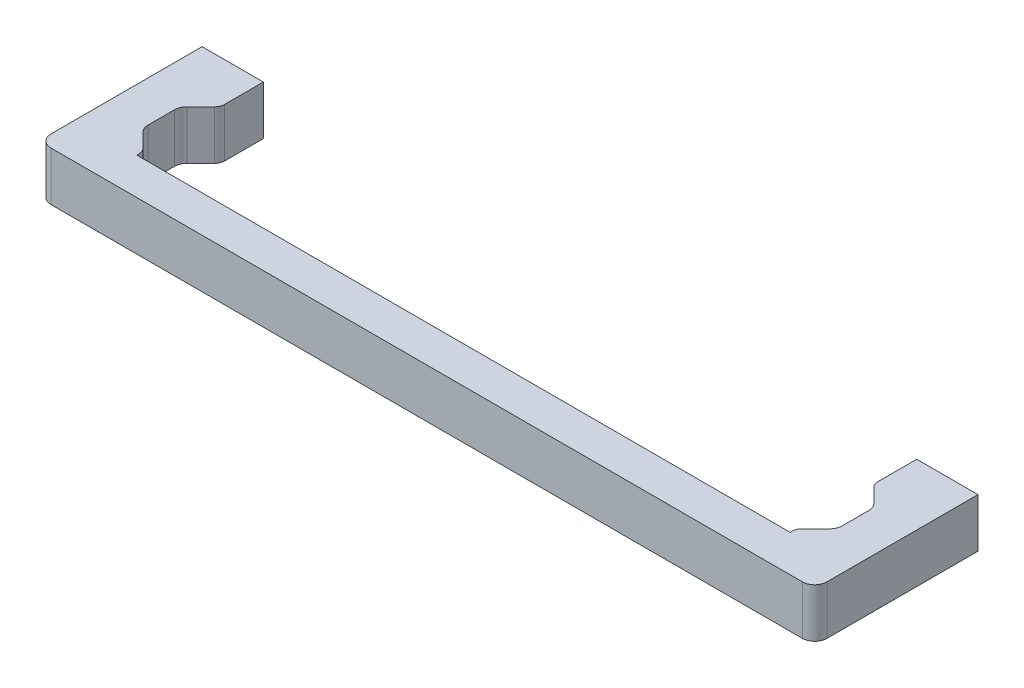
ISO-10303-21;
HEADER;
FILE_DESCRIPTION(('STEP AP214'),'2;1');
FILE_NAME('part.step','',(''),(''),'','','');
FILE_SCHEMA(('AUTOMOTIVE_DESIGN { 1 0 10303 214 1 1 1 1 }'));
ENDSEC;
DATA;
#1=APPLICATION_CONTEXT('core data for automotive mechanical design processes');
#2=APPLICATION_PROTOCOL_DEFINITION('international standard','automotive_design',2000,#1);
#3=PRODUCT_CONTEXT('',#1,'mechanical');
#4=PRODUCT('Part','Part','',(#3));
#5=PRODUCT_RELATED_PRODUCT_CATEGORY('part','',(#4));
#6=PRODUCT_DEFINITION_FORMATION('','',#4);
#7=PRODUCT_DEFINITION_CONTEXT('part definition',#1,'design');
#8=PRODUCT_DEFINITION('design','',#6,#7);
#9=PRODUCT_DEFINITION_SHAPE('','',#8);
#10=(LENGTH_UNIT() NAMED_UNIT(*) SI_UNIT(.MILLI.,.METRE.));
#11=(NAMED_UNIT(*) PLANE_ANGLE_UNIT() SI_UNIT($,.RADIAN.));
#12=(NAMED_UNIT(*) SI_UNIT($,.STERADIAN.) SOLID_ANGLE_UNIT());
#13=UNCERTAINTY_MEASURE_WITH_UNIT(LENGTH_MEASURE(1.E-05),#10,'distance_accuracy_value','');
#14=(GEOMETRIC_REPRESENTATION_CONTEXT(3) GLOBAL_UNCERTAINTY_ASSIGNED_CONTEXT((#13)) GLOBAL_UNIT_ASSIGNED_CONTEXT((#10,
#11,#12)) REPRESENTATION_CONTEXT('',''));
#15=CARTESIAN_POINT('',(0.,0.,0.));
#16=DIRECTION('',(0.,0.,1.));
#17=DIRECTION('',(1.,0.,0.));
#18=AXIS2_PLACEMENT_3D('',#15,#16,#17);
#19=CARTESIAN_POINT('',(-1.999375,-6.,36.998073));
#20=DIRECTION('',(0.,1.,0.));
#21=DIRECTION('',(-1.,0.,0.));
#22=AXIS2_PLACEMENT_3D('',#19,#20,#21);
#23=CYLINDRICAL_SURFACE('',#22,2.999844);
#24=DIRECTION('',(0.,1.,0.));
#25=VECTOR('',#24,1.);
#26=CARTESIAN_POINT('',(-4.999219,-6.,36.998073));
#27=LINE('',#26,#25);
#28=CARTESIAN_POINT('',(-4.999219,-6.,36.998073));
#29=VERTEX_POINT('',#28);
#30=CARTESIAN_POINT('',(-4.999219,6.,36.998073));
#31=VERTEX_POINT('',#30);
#32=EDGE_CURVE('E9',#29,#31,#27,.T.);
#33=ORIENTED_EDGE('',*,*,#32,.F.);
#34=CARTESIAN_POINT('',(-1.999375,-6.,36.998073));
#35=DIRECTION('',(0.,-1.,0.));
#36=DIRECTION('',(1.,0.,0.));
#37=AXIS2_PLACEMENT_3D('',#34,#35,#36);
#38=CIRCLE('',#37,2.999844);
#39=CARTESIAN_POINT('',(-1.999375,-6.,39.997917));
#40=VERTEX_POINT('',#39);
#41=EDGE_CURVE('E277',#40,#29,#38,.T.);
#42=ORIENTED_EDGE('',*,*,#41,.F.);
#43=DIRECTION('',(0.,1.,0.));
#44=VECTOR('',#43,1.);
#45=CARTESIAN_POINT('',(-1.999375,-6.,39.997917));
#46=LINE('',#45,#44);
#47=CARTESIAN_POINT('',(-1.999375,6.,39.997917));
#48=VERTEX_POINT('',#47);
#49=EDGE_CURVE('E29',#40,#48,#46,.T.);
#50=ORIENTED_EDGE('',*,*,#49,.T.);
#51=CARTESIAN_POINT('',(-1.999375,6.,36.998073));
#52=DIRECTION('',(0.,-1.,0.));
#53=DIRECTION('',(1.,0.,0.));
#54=AXIS2_PLACEMENT_3D('',#51,#52,#53);
#55=CIRCLE('',#54,2.999844);
#56=EDGE_CURVE('E197',#48,#31,#55,.T.);
#57=ORIENTED_EDGE('',*,*,#56,.T.);
#58=EDGE_LOOP('',(#33,#42,#50,#57));
#59=FACE_BOUND('',#58,.T.);
#60=ADVANCED_FACE('F14',(#59),#23,.T.);
#61=CARTESIAN_POINT('',(-4.999219,-6.,36.998073));
#62=DIRECTION('',(1.,0.,0.));
#63=DIRECTION('',(0.,1.,0.));
#64=AXIS2_PLACEMENT_3D('',#61,#62,#63);
#65=PLANE('',#64);
#66=DIRECTION('',(0.,1.,0.));
#67=VECTOR('',#66,1.);
#68=CARTESIAN_POINT('',(-4.999219,-6.,0.));
#69=LINE('',#68,#67);
#70=CARTESIAN_POINT('',(-4.999219,-6.,0.));
#71=VERTEX_POINT('',#70);
#72=CARTESIAN_POINT('',(-4.999219,6.,0.));
#73=VERTEX_POINT('',#72);
#74=EDGE_CURVE('E22',#71,#73,#69,.T.);
#75=ORIENTED_EDGE('',*,*,#74,.F.);
#76=DIRECTION('',(0.,0.,-1.));
#77=VECTOR('',#76,1.);
#78=CARTESIAN_POINT('',(-4.999219,-6.,36.998073));
#79=LINE('',#78,#77);
#80=EDGE_CURVE('E193',#29,#71,#79,.T.);
#81=ORIENTED_EDGE('',*,*,#80,.F.);
#82=ORIENTED_EDGE('',*,*,#32,.T.);
#83=DIRECTION('',(0.,0.,-1.));
#84=VECTOR('',#83,1.);
#85=CARTESIAN_POINT('',(-4.999219,6.,36.998073));
#86=LINE('',#85,#84);
#87=EDGE_CURVE('E190',#31,#73,#86,.T.);
#88=ORIENTED_EDGE('',*,*,#87,.T.);
#89=EDGE_LOOP('',(#75,#81,#82,#88));
#90=FACE_BOUND('',#89,.T.);
#91=ADVANCED_FACE('F16',(#90),#65,.F.);
#92=CARTESIAN_POINT('',(-4.999219,-6.,0.));
#93=DIRECTION('',(0.,0.,1.));
#94=DIRECTION('',(0.,-1.,0.));
#95=AXIS2_PLACEMENT_3D('',#92,#93,#94);
#96=PLANE('',#95);
#97=CARTESIAN_POINT('',(0.,0.,0.));
#98=DIRECTION('',(0.,0.,-1.));
#99=DIRECTION('',(0.,1.,0.));
#100=AXIS2_PLACEMENT_3D('',#97,#98,#99);
#101=CIRCLE('',#100,2.5);
#102=CARTESIAN_POINT('',(0.,2.5,0.));
#103=VERTEX_POINT('',#102);
#104=EDGE_CURVE('E763',#103,#103,#101,.T.);
#105=ORIENTED_EDGE('',*,*,#104,.F.);
#106=EDGE_LOOP('',(#105));
#107=FACE_BOUND('',#106,.T.);
#108=DIRECTION('',(0.,1.,0.));
#109=VECTOR('',#108,1.);
#110=CARTESIAN_POINT('',(10.,-6.,0.));
#111=LINE('',#110,#109);
#112=CARTESIAN_POINT('',(10.,-6.,0.));
#113=VERTEX_POINT('',#112);
#114=CARTESIAN_POINT('',(10.,6.,0.));
#115=VERTEX_POINT('',#114);
#116=EDGE_CURVE('E394',#113,#115,#111,.T.);
#117=ORIENTED_EDGE('',*,*,#116,.F.);
#118=DIRECTION('',(1.,0.,0.));
#119=VECTOR('',#118,1.);
#120=CARTESIAN_POINT('',(-4.999219,-6.,0.));
#121=LINE('',#120,#119);
#122=EDGE_CURVE('E280',#71,#113,#121,.T.);
#123=ORIENTED_EDGE('',*,*,#122,.F.);
#124=ORIENTED_EDGE('',*,*,#74,.T.);
#125=DIRECTION('',(1.,0.,0.));
#126=VECTOR('',#125,1.);
#127=CARTESIAN_POINT('',(-4.999219,6.,0.));
#128=LINE('',#127,#126);
#129=EDGE_CURVE('E205',#73,#115,#128,.T.);
#130=ORIENTED_EDGE('',*,*,#129,.T.);
#131=EDGE_LOOP('',(#117,#123,#124,#130));
#132=FACE_BOUND('',#131,.T.);
#133=ADVANCED_FACE('F397',(#107,#132),#96,.F.);
#134=CARTESIAN_POINT('',(10.,-6.,0.));
#135=DIRECTION('',(-1.,0.,0.));
#136=DIRECTION('',(0.,0.,-1.));
#137=AXIS2_PLACEMENT_3D('',#134,#135,#136);
#138=PLANE('',#137);
#139=DIRECTION('',(0.,1.,0.));
#140=VECTOR('',#139,1.);
#141=CARTESIAN_POINT('',(10.,-6.,9.463973));
#142=LINE('',#141,#140);
#143=CARTESIAN_POINT('',(10.,-6.,9.463973));
#144=VERTEX_POINT('',#143);
#145=CARTESIAN_POINT('',(10.,6.,9.463973));
#146=VERTEX_POINT('',#145);
#147=EDGE_CURVE('E392',#144,#146,#142,.T.);
#148=ORIENTED_EDGE('',*,*,#147,.F.);
#149=DIRECTION('',(0.,0.,1.));
#150=VECTOR('',#149,1.);
#151=CARTESIAN_POINT('',(10.,-6.,0.));
#152=LINE('',#151,#150);
#153=EDGE_CURVE('E283',#113,#144,#152,.T.);
#154=ORIENTED_EDGE('',*,*,#153,.F.);
#155=ORIENTED_EDGE('',*,*,#116,.T.);
#156=DIRECTION('',(0.,0.,1.));
#157=VECTOR('',#156,1.);
#158=CARTESIAN_POINT('',(10.,6.,0.));
#159=LINE('',#158,#157);
#160=EDGE_CURVE('E207',#115,#146,#159,.T.);
#161=ORIENTED_EDGE('',*,*,#160,.T.);
#162=EDGE_LOOP('',(#148,#154,#155,#161));
#163=FACE_BOUND('',#162,.T.);
#164=ADVANCED_FACE('F486',(#163),#138,.F.);
#165=CARTESIAN_POINT('',(7.50013,-6.,9.463973));
#166=DIRECTION('',(0.,1.,0.));
#167=DIRECTION('',(-1.,0.,0.));
#168=AXIS2_PLACEMENT_3D('',#165,#166,#167);
#169=CYLINDRICAL_SURFACE('',#168,2.49987);
#170=DIRECTION('',(0.,1.,0.));
#171=VECTOR('',#170,1.);
#172=CARTESIAN_POINT('',(9.26780502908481,-6.,11.2316480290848));
#173=LINE('',#172,#171);
#174=CARTESIAN_POINT('',(9.26780502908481,-6.,11.2316480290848));
#175=VERTEX_POINT('',#174);
#176=CARTESIAN_POINT('',(9.26780502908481,6.,11.2316480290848));
#177=VERTEX_POINT('',#176);
#178=EDGE_CURVE('E390',#175,#177,#173,.T.);
#179=ORIENTED_EDGE('',*,*,#178,.F.);
#180=CARTESIAN_POINT('',(7.50013,-6.,9.463973));
#181=DIRECTION('',(0.,-1.,0.));
#182=DIRECTION('',(1.,0.,0.));
#183=AXIS2_PLACEMENT_3D('',#180,#181,#182);
#184=CIRCLE('',#183,2.49987);
#185=EDGE_CURVE('E286',#144,#175,#184,.T.);
#186=ORIENTED_EDGE('',*,*,#185,.F.);
#187=ORIENTED_EDGE('',*,*,#147,.T.);
#188=CARTESIAN_POINT('',(7.50013,6.,9.463973));
#189=DIRECTION('',(0.,-1.,0.));
#190=DIRECTION('',(1.,0.,0.));
#191=AXIS2_PLACEMENT_3D('',#188,#189,#190);
#192=CIRCLE('',#191,2.49987);
#193=EDGE_CURVE('E213',#146,#177,#192,.T.);
#194=ORIENTED_EDGE('',*,*,#193,.T.);
#195=EDGE_LOOP('',(#179,#186,#187,#194));
#196=FACE_BOUND('',#195,.T.);
#197=ADVANCED_FACE('F484',(#196),#169,.T.);
#198=CARTESIAN_POINT('',(5.87889396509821,-6.,14.6205589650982));
#199=DIRECTION('',(0.707106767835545,0.,0.70710679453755));
#200=DIRECTION('',(-0.70710679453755,0.,0.707106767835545));
#201=AXIS2_PLACEMENT_3D('',#198,#199,#200);
#202=PLANE('',#201);
#203=DIRECTION('',(0.,1.,0.));
#204=VECTOR('',#203,1.);
#205=CARTESIAN_POINT('',(5.87889396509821,-6.,14.6205589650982));
#206=LINE('',#205,#204);
#207=CARTESIAN_POINT('',(5.87889396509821,-6.,14.6205589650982));
#208=VERTEX_POINT('',#207);
#209=CARTESIAN_POINT('',(5.87889396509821,6.,14.6205589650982));
#210=VERTEX_POINT('',#209);
#211=EDGE_CURVE('E388',#208,#210,#206,.T.);
#212=ORIENTED_EDGE('',*,*,#211,.F.);
#213=DIRECTION('',(0.70710679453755,0.,-0.707106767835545));
#214=VECTOR('',#213,1.);
#215=CARTESIAN_POINT('',(5.87889396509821,-6.,14.6205589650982));
#216=LINE('',#215,#214);
#217=EDGE_CURVE('E289',#208,#175,#216,.T.);
#218=ORIENTED_EDGE('',*,*,#217,.T.);
#219=ORIENTED_EDGE('',*,*,#178,.T.);
#220=DIRECTION('',(0.70710679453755,0.,-0.707106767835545));
#221=VECTOR('',#220,1.);
#222=CARTESIAN_POINT('',(5.87889396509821,6.,14.6205589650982));
#223=LINE('',#222,#221);
#224=EDGE_CURVE('E216',#210,#177,#223,.T.);
#225=ORIENTED_EDGE('',*,*,#224,.F.);
#226=EDGE_LOOP('',(#212,#218,#219,#225));
#227=FACE_BOUND('',#226,.T.);
#228=ADVANCED_FACE('F480',(#227),#202,.T.);
#229=CARTESIAN_POINT('',(8.000104,-6.,16.741769));
#230=DIRECTION('',(0.,1.,0.));
#231=DIRECTION('',(-1.,0.,0.));
#232=AXIS2_PLACEMENT_3D('',#229,#230,#231);
#233=CYLINDRICAL_SURFACE('',#232,2.999844);
#234=DIRECTION('',(0.,1.,0.));
#235=VECTOR('',#234,1.);
#236=CARTESIAN_POINT('',(5.00026,-6.,16.741769));
#237=LINE('',#236,#235);
#238=CARTESIAN_POINT('',(5.00026,-6.,16.741769));
#239=VERTEX_POINT('',#238);
#240=CARTESIAN_POINT('',(5.00026,6.,16.741769));
#241=VERTEX_POINT('',#240);
#242=EDGE_CURVE('E386',#239,#241,#237,.T.);
#243=ORIENTED_EDGE('',*,*,#242,.F.);
#244=CARTESIAN_POINT('',(8.000104,-6.,16.741769));
#245=DIRECTION('',(0.,-1.,0.));
#246=DIRECTION('',(1.,0.,0.));
#247=AXIS2_PLACEMENT_3D('',#244,#245,#246);
#248=CIRCLE('',#247,2.999844);
#249=EDGE_CURVE('E292',#239,#208,#248,.T.);
#250=ORIENTED_EDGE('',*,*,#249,.T.);
#251=ORIENTED_EDGE('',*,*,#211,.T.);
#252=CARTESIAN_POINT('',(8.000104,6.,16.741769));
#253=DIRECTION('',(0.,-1.,0.));
#254=DIRECTION('',(1.,0.,0.));
#255=AXIS2_PLACEMENT_3D('',#252,#253,#254);
#256=CIRCLE('',#255,2.999844);
#257=EDGE_CURVE('E219',#241,#210,#256,.T.);
#258=ORIENTED_EDGE('',*,*,#257,.F.);
#259=EDGE_LOOP('',(#243,#250,#251,#258));
#260=FACE_BOUND('',#259,.T.);
#261=ADVANCED_FACE('F476',(#260),#233,.F.);
#262=CARTESIAN_POINT('',(5.00026,-6.,23.256148));
#263=DIRECTION('',(1.,0.,0.));
#264=DIRECTION('',(0.,1.,0.));
#265=AXIS2_PLACEMENT_3D('',#262,#263,#264);
#266=PLANE('',#265);
#267=DIRECTION('',(0.,1.,0.));
#268=VECTOR('',#267,1.);
#269=CARTESIAN_POINT('',(5.00026,-6.,23.256148));
#270=LINE('',#269,#268);
#271=CARTESIAN_POINT('',(5.00026,-6.,23.256148));
#272=VERTEX_POINT('',#271);
#273=CARTESIAN_POINT('',(5.00026,6.,23.256148));
#274=VERTEX_POINT('',#273);
#275=EDGE_CURVE('E384',#272,#274,#270,.T.);
#276=ORIENTED_EDGE('',*,*,#275,.F.);
#277=DIRECTION('',(0.,0.,-1.));
#278=VECTOR('',#277,1.);
#279=CARTESIAN_POINT('',(5.00026,-6.,23.256148));
#280=LINE('',#279,#278);
#281=EDGE_CURVE('E295',#272,#239,#280,.T.);
#282=ORIENTED_EDGE('',*,*,#281,.T.);
#283=ORIENTED_EDGE('',*,*,#242,.T.);
#284=DIRECTION('',(0.,0.,-1.));
#285=VECTOR('',#284,1.);
#286=CARTESIAN_POINT('',(5.00026,6.,23.256148));
#287=LINE('',#286,#285);
#288=EDGE_CURVE('E222',#274,#241,#287,.T.);
#289=ORIENTED_EDGE('',*,*,#288,.F.);
#290=EDGE_LOOP('',(#276,#282,#283,#289));
#291=FACE_BOUND('',#290,.T.);
#292=ADVANCED_FACE('F472',(#291),#266,.T.);
#293=CARTESIAN_POINT('',(8.000104,-6.,23.256148));
#294=DIRECTION('',(0.,1.,0.));
#295=DIRECTION('',(-1.,0.,0.));
#296=AXIS2_PLACEMENT_3D('',#293,#294,#295);
#297=CYLINDRICAL_SURFACE('',#296,2.999844);
#298=DIRECTION('',(0.,1.,0.));
#299=VECTOR('',#298,1.);
#300=CARTESIAN_POINT('',(5.87889396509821,-6.,25.3773580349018));
#301=LINE('',#300,#299);
#302=CARTESIAN_POINT('',(5.87889396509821,-6.,25.3773580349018));
#303=VERTEX_POINT('',#302);
#304=CARTESIAN_POINT('',(5.87889396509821,6.,25.3773580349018));
#305=VERTEX_POINT('',#304);
#306=EDGE_CURVE('E382',#303,#305,#301,.T.);
#307=ORIENTED_EDGE('',*,*,#306,.F.);
#308=CARTESIAN_POINT('',(8.000104,-6.,23.256148));
#309=DIRECTION('',(0.,-1.,0.));
#310=DIRECTION('',(1.,0.,0.));
#311=AXIS2_PLACEMENT_3D('',#308,#309,#310);
#312=CIRCLE('',#311,2.999844);
#313=EDGE_CURVE('E298',#303,#272,#312,.T.);
#314=ORIENTED_EDGE('',*,*,#313,.T.);
#315=ORIENTED_EDGE('',*,*,#275,.T.);
#316=CARTESIAN_POINT('',(8.000104,6.,23.256148));
#317=DIRECTION('',(0.,-1.,0.));
#318=DIRECTION('',(1.,0.,0.));
#319=AXIS2_PLACEMENT_3D('',#316,#317,#318);
#320=CIRCLE('',#319,2.999844);
#321=EDGE_CURVE('E225',#305,#274,#320,.T.);
#322=ORIENTED_EDGE('',*,*,#321,.F.);
#323=EDGE_LOOP('',(#307,#314,#315,#322));
#324=FACE_BOUND('',#323,.T.);
#325=ADVANCED_FACE('F468',(#324),#297,.F.);
#326=CARTESIAN_POINT('',(5.87889396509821,-6.,25.3773580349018));
#327=DIRECTION('',(-0.707106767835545,0.,0.70710679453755));
#328=DIRECTION('',(-0.70710679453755,0.,-0.707106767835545));
#329=AXIS2_PLACEMENT_3D('',#326,#327,#328);
#330=PLANE('',#329);
#331=DIRECTION('',(0.,1.,0.));
#332=VECTOR('',#331,1.);
#333=CARTESIAN_POINT('',(9.26780502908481,-6.,28.7662689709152));
#334=LINE('',#333,#332);
#335=CARTESIAN_POINT('',(9.26780502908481,-6.,28.7662689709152));
#336=VERTEX_POINT('',#335);
#337=CARTESIAN_POINT('',(9.26780502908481,6.,28.7662689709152));
#338=VERTEX_POINT('',#337);
#339=EDGE_CURVE('E380',#336,#338,#334,.T.);
#340=ORIENTED_EDGE('',*,*,#339,.F.);
#341=DIRECTION('',(0.70710679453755,0.,0.707106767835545));
#342=VECTOR('',#341,1.);
#343=CARTESIAN_POINT('',(5.87889396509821,-6.,25.3773580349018));
#344=LINE('',#343,#342);
#345=EDGE_CURVE('E301',#303,#336,#344,.T.);
#346=ORIENTED_EDGE('',*,*,#345,.F.);
#347=ORIENTED_EDGE('',*,*,#306,.T.);
#348=DIRECTION('',(0.70710679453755,0.,0.707106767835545));
#349=VECTOR('',#348,1.);
#350=CARTESIAN_POINT('',(5.87889396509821,6.,25.3773580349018));
#351=LINE('',#350,#349);
#352=EDGE_CURVE('E228',#305,#338,#351,.T.);
#353=ORIENTED_EDGE('',*,*,#352,.T.);
#354=EDGE_LOOP('',(#340,#346,#347,#353));
#355=FACE_BOUND('',#354,.T.);
#356=ADVANCED_FACE('F464',(#355),#330,.F.);
#357=CARTESIAN_POINT('',(7.50013,-6.,30.533944));
#358=DIRECTION('',(0.,1.,0.));
#359=DIRECTION('',(-1.,0.,0.));
#360=AXIS2_PLACEMENT_3D('',#357,#358,#359);
#361=CYLINDRICAL_SURFACE('',#360,2.49987);
#362=DIRECTION('',(0.,1.,0.));
#363=VECTOR('',#362,1.);
#364=CARTESIAN_POINT('',(10.,-6.,30.533944));
#365=LINE('',#364,#363);
#366=CARTESIAN_POINT('',(10.,-6.,30.533944));
#367=VERTEX_POINT('',#366);
#368=CARTESIAN_POINT('',(10.,6.,30.533944));
#369=VERTEX_POINT('',#368);
#370=EDGE_CURVE('E378',#367,#369,#365,.T.);
#371=ORIENTED_EDGE('',*,*,#370,.F.);
#372=CARTESIAN_POINT('',(7.50013,-6.,30.533944));
#373=DIRECTION('',(0.,-1.,0.));
#374=DIRECTION('',(1.,0.,0.));
#375=AXIS2_PLACEMENT_3D('',#372,#373,#374);
#376=CIRCLE('',#375,2.49987);
#377=EDGE_CURVE('E304',#336,#367,#376,.T.);
#378=ORIENTED_EDGE('',*,*,#377,.F.);
#379=ORIENTED_EDGE('',*,*,#339,.T.);
#380=CARTESIAN_POINT('',(7.50013,6.,30.533944));
#381=DIRECTION('',(0.,-1.,0.));
#382=DIRECTION('',(1.,0.,0.));
#383=AXIS2_PLACEMENT_3D('',#380,#381,#382);
#384=CIRCLE('',#383,2.49987);
#385=EDGE_CURVE('E231',#338,#369,#384,.T.);
#386=ORIENTED_EDGE('',*,*,#385,.T.);
#387=EDGE_LOOP('',(#371,#378,#379,#386));
#388=FACE_BOUND('',#387,.T.);
#389=ADVANCED_FACE('F461',(#388),#361,.T.);
#390=CARTESIAN_POINT('',(10.,-6.,30.533944));
#391=DIRECTION('',(-1.,0.,0.));
#392=DIRECTION('',(0.,0.,-1.));
#393=AXIS2_PLACEMENT_3D('',#390,#391,#392);
#394=PLANE('',#393);
#395=DIRECTION('',(0.,1.,0.));
#396=VECTOR('',#395,1.);
#397=CARTESIAN_POINT('',(10.,-6.,30.998386));
#398=LINE('',#397,#396);
#399=CARTESIAN_POINT('',(10.,-6.,30.998386));
#400=VERTEX_POINT('',#399);
#401=CARTESIAN_POINT('',(10.,6.,30.998386));
#402=VERTEX_POINT('',#401);
#403=EDGE_CURVE('E376',#400,#402,#398,.T.);
#404=ORIENTED_EDGE('',*,*,#403,.F.);
#405=DIRECTION('',(0.,0.,1.));
#406=VECTOR('',#405,1.);
#407=CARTESIAN_POINT('',(10.,-6.,30.533944));
#408=LINE('',#407,#406);
#409=EDGE_CURVE('E307',#367,#400,#408,.T.);
#410=ORIENTED_EDGE('',*,*,#409,.F.);
#411=ORIENTED_EDGE('',*,*,#370,.T.);
#412=DIRECTION('',(0.,0.,1.));
#413=VECTOR('',#412,1.);
#414=CARTESIAN_POINT('',(10.,6.,30.533944));
#415=LINE('',#414,#413);
#416=EDGE_CURVE('E234',#369,#402,#415,.T.);
#417=ORIENTED_EDGE('',*,*,#416,.T.);
#418=EDGE_LOOP('',(#404,#410,#411,#417));
#419=FACE_BOUND('',#418,.T.);
#420=ADVANCED_FACE('F457',(#419),#394,.F.);
#421=CARTESIAN_POINT('',(10.,-6.,30.998386));
#422=DIRECTION('',(0.,0.,1.));
#423=DIRECTION('',(0.,-1.,0.));
#424=AXIS2_PLACEMENT_3D('',#421,#422,#423);
#425=PLANE('',#424);
#426=DIRECTION('',(0.,1.,0.));
#427=VECTOR('',#426,1.);
#428=CARTESIAN_POINT('',(170.001562,-6.,30.998386));
#429=LINE('',#428,#427);
#430=CARTESIAN_POINT('',(170.001562,-6.,30.998386));
#431=VERTEX_POINT('',#430);
#432=CARTESIAN_POINT('',(170.001562,6.,30.998386));
#433=VERTEX_POINT('',#432);
#434=EDGE_CURVE('E374',#431,#433,#429,.T.);
#435=ORIENTED_EDGE('',*,*,#434,.F.);
#436=DIRECTION('',(1.,0.,0.));
#437=VECTOR('',#436,1.);
#438=CARTESIAN_POINT('',(10.,-6.,30.998386));
#439=LINE('',#438,#437);
#440=EDGE_CURVE('E310',#400,#431,#439,.T.);
#441=ORIENTED_EDGE('',*,*,#440,.F.);
#442=ORIENTED_EDGE('',*,*,#403,.T.);
#443=DIRECTION('',(1.,0.,0.));
#444=VECTOR('',#443,1.);
#445=CARTESIAN_POINT('',(10.,6.,30.998386));
#446=LINE('',#445,#444);
#447=EDGE_CURVE('E237',#402,#433,#446,.T.);
#448=ORIENTED_EDGE('',*,*,#447,.T.);
#449=EDGE_LOOP('',(#435,#441,#442,#448));
#450=FACE_BOUND('',#449,.T.);
#451=ADVANCED_FACE('F452',(#450),#425,.F.);
#452=CARTESIAN_POINT('',(170.001562,-6.,30.533944));
#453=DIRECTION('',(-1.,0.,0.));
#454=DIRECTION('',(0.,-1.,0.));
#455=AXIS2_PLACEMENT_3D('',#452,#453,#454);
#456=PLANE('',#455);
#457=DIRECTION('',(0.,1.,0.));
#458=VECTOR('',#457,1.);
#459=CARTESIAN_POINT('',(170.001562,-6.,30.533944));
#460=LINE('',#459,#458);
#461=CARTESIAN_POINT('',(170.001562,-6.,30.533944));
#462=VERTEX_POINT('',#461);
#463=CARTESIAN_POINT('',(170.001562,6.,30.533944));
#464=VERTEX_POINT('',#463);
#465=EDGE_CURVE('E372',#462,#464,#460,.T.);
#466=ORIENTED_EDGE('',*,*,#465,.F.);
#467=DIRECTION('',(0.,0.,1.));
#468=VECTOR('',#467,1.);
#469=CARTESIAN_POINT('',(170.001562,-6.,30.533944));
#470=LINE('',#469,#468);
#471=EDGE_CURVE('E313',#462,#431,#470,.T.);
#472=ORIENTED_EDGE('',*,*,#471,.T.);
#473=ORIENTED_EDGE('',*,*,#434,.T.);
#474=DIRECTION('',(0.,0.,1.));
#475=VECTOR('',#474,1.);
#476=CARTESIAN_POINT('',(170.001562,6.,30.533944));
#477=LINE('',#476,#475);
#478=EDGE_CURVE('E240',#464,#433,#477,.T.);
#479=ORIENTED_EDGE('',*,*,#478,.F.);
#480=EDGE_LOOP('',(#466,#472,#473,#479));
#481=FACE_BOUND('',#480,.T.);
#482=ADVANCED_FACE('F449',(#481),#456,.T.);
#483=CARTESIAN_POINT('',(172.501432,-6.,30.533944));
#484=DIRECTION('',(0.,1.,0.));
#485=DIRECTION('',(-1.,0.,0.));
#486=AXIS2_PLACEMENT_3D('',#483,#484,#485);
#487=CYLINDRICAL_SURFACE('',#486,2.49986997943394);
#488=DIRECTION('',(0.,1.,0.));
#489=VECTOR('',#488,1.);
#490=CARTESIAN_POINT('',(170.733756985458,-6.,28.7662689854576));
#491=LINE('',#490,#489);
#492=CARTESIAN_POINT('',(170.733756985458,-6.,28.7662689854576));
#493=VERTEX_POINT('',#492);
#494=CARTESIAN_POINT('',(170.733756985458,6.,28.7662689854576));
#495=VERTEX_POINT('',#494);
#496=EDGE_CURVE('E370',#493,#495,#491,.T.);
#497=ORIENTED_EDGE('',*,*,#496,.F.);
#498=CARTESIAN_POINT('',(172.501432,-6.,30.533944));
#499=DIRECTION('',(0.,-1.,0.));
#500=DIRECTION('',(1.,0.,0.));
#501=AXIS2_PLACEMENT_3D('',#498,#499,#500);
#502=CIRCLE('',#501,2.49986997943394);
#503=EDGE_CURVE('E316',#462,#493,#502,.T.);
#504=ORIENTED_EDGE('',*,*,#503,.F.);
#505=ORIENTED_EDGE('',*,*,#465,.T.);
#506=CARTESIAN_POINT('',(172.501432,6.,30.533944));
#507=DIRECTION('',(0.,-1.,0.));
#508=DIRECTION('',(1.,0.,0.));
#509=AXIS2_PLACEMENT_3D('',#506,#507,#508);
#510=CIRCLE('',#509,2.49986997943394);
#511=EDGE_CURVE('E243',#464,#495,#510,.T.);
#512=ORIENTED_EDGE('',*,*,#511,.T.);
#513=EDGE_LOOP('',(#497,#504,#505,#512));
#514=FACE_BOUND('',#513,.T.);
#515=ADVANCED_FACE('F445',(#514),#487,.T.);
#516=CARTESIAN_POINT('',(174.122668,-6.,25.377358));
#517=DIRECTION('',(-0.707106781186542,0.,-0.707106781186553));
#518=DIRECTION('',(0.707106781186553,0.,-0.707106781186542));
#519=AXIS2_PLACEMENT_3D('',#516,#517,#518);
#520=PLANE('',#519);
#521=DIRECTION('',(0.,1.,0.));
#522=VECTOR('',#521,1.);
#523=CARTESIAN_POINT('',(174.122668,-6.,25.377358));
#524=LINE('',#523,#522);
#525=CARTESIAN_POINT('',(174.122668,-6.,25.377358));
#526=VERTEX_POINT('',#525);
#527=CARTESIAN_POINT('',(174.122668,6.,25.377358));
#528=VERTEX_POINT('',#527);
#529=EDGE_CURVE('E368',#526,#528,#524,.T.);
#530=ORIENTED_EDGE('',*,*,#529,.F.);
#531=DIRECTION('',(-0.707106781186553,0.,0.707106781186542));
#532=VECTOR('',#531,1.);
#533=CARTESIAN_POINT('',(174.122668,-6.,25.377358));
#534=LINE('',#533,#532);
#535=EDGE_CURVE('E319',#526,#493,#534,.T.);
#536=ORIENTED_EDGE('',*,*,#535,.T.);
#537=ORIENTED_EDGE('',*,*,#496,.T.);
#538=DIRECTION('',(-0.707106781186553,0.,0.707106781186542));
#539=VECTOR('',#538,1.);
#540=CARTESIAN_POINT('',(174.122668,6.,25.377358));
#541=LINE('',#540,#539);
#542=EDGE_CURVE('E246',#528,#495,#541,.T.);
#543=ORIENTED_EDGE('',*,*,#542,.F.);
#544=EDGE_LOOP('',(#530,#536,#537,#543));
#545=FACE_BOUND('',#544,.T.);
#546=ADVANCED_FACE('F440',(#545),#520,.T.);
#547=CARTESIAN_POINT('',(172.001458,-6.,23.256148));
#548=DIRECTION('',(0.,1.,0.));
#549=DIRECTION('',(-1.,0.,0.));
#550=AXIS2_PLACEMENT_3D('',#547,#548,#549);
#551=CYLINDRICAL_SURFACE('',#550,2.9998439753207);
#552=DIRECTION('',(0.,1.,0.));
#553=VECTOR('',#552,1.);
#554=CARTESIAN_POINT('',(175.001301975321,-6.,23.256148));
#555=LINE('',#554,#553);
#556=CARTESIAN_POINT('',(175.001301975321,-6.,23.256148));
#557=VERTEX_POINT('',#556);
#558=CARTESIAN_POINT('',(175.001301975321,6.,23.256148));
#559=VERTEX_POINT('',#558);
#560=EDGE_CURVE('E366',#557,#559,#555,.T.);
#561=ORIENTED_EDGE('',*,*,#560,.F.);
#562=CARTESIAN_POINT('',(172.001458,-6.,23.256148));
#563=DIRECTION('',(0.,-1.,0.));
#564=DIRECTION('',(1.,0.,0.));
#565=AXIS2_PLACEMENT_3D('',#562,#563,#564);
#566=CIRCLE('',#565,2.9998439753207);
#567=EDGE_CURVE('E322',#557,#526,#566,.T.);
#568=ORIENTED_EDGE('',*,*,#567,.T.);
#569=ORIENTED_EDGE('',*,*,#529,.T.);
#570=CARTESIAN_POINT('',(172.001458,6.,23.256148));
#571=DIRECTION('',(0.,-1.,0.));
#572=DIRECTION('',(1.,0.,0.));
#573=AXIS2_PLACEMENT_3D('',#570,#571,#572);
#574=CIRCLE('',#573,2.9998439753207);
#575=EDGE_CURVE('E249',#559,#528,#574,.T.);
#576=ORIENTED_EDGE('',*,*,#575,.F.);
#577=EDGE_LOOP('',(#561,#568,#569,#576));
#578=FACE_BOUND('',#577,.T.);
#579=ADVANCED_FACE('F436',(#578),#551,.F.);
#580=CARTESIAN_POINT('',(175.001302,-6.,23.256148));
#581=DIRECTION('',(1.,0.,0.));
#582=DIRECTION('',(0.,1.,0.));
#583=AXIS2_PLACEMENT_3D('',#580,#581,#582);
#584=PLANE('',#583);
#585=DIRECTION('',(0.,1.,0.));
#586=VECTOR('',#585,1.);
#587=CARTESIAN_POINT('',(175.001302,-6.,16.741769));
#588=LINE('',#587,#586);
#589=CARTESIAN_POINT('',(175.001302,-6.,16.741769));
#590=VERTEX_POINT('',#589);
#591=CARTESIAN_POINT('',(175.001302,6.,16.741769));
#592=VERTEX_POINT('',#591);
#593=EDGE_CURVE('E364',#590,#592,#588,.T.);
#594=ORIENTED_EDGE('',*,*,#593,.F.);
#595=DIRECTION('',(0.,0.,-1.));
#596=VECTOR('',#595,1.);
#597=CARTESIAN_POINT('',(175.001302,-6.,23.256148));
#598=LINE('',#597,#596);
#599=EDGE_CURVE('E325',#557,#590,#598,.T.);
#600=ORIENTED_EDGE('',*,*,#599,.F.);
#601=ORIENTED_EDGE('',*,*,#560,.T.);
#602=DIRECTION('',(0.,0.,-1.));
#603=VECTOR('',#602,1.);
#604=CARTESIAN_POINT('',(175.001302,6.,23.256148));
#605=LINE('',#604,#603);
#606=EDGE_CURVE('E252',#559,#592,#605,.T.);
#607=ORIENTED_EDGE('',*,*,#606,.T.);
#608=EDGE_LOOP('',(#594,#600,#601,#607));
#609=FACE_BOUND('',#608,.T.);
#610=ADVANCED_FACE('F432',(#609),#584,.F.);
#611=CARTESIAN_POINT('',(172.001458,-6.,16.741769));
#612=DIRECTION('',(0.,1.,0.));
#613=DIRECTION('',(-1.,0.,0.));
#614=AXIS2_PLACEMENT_3D('',#611,#612,#613);
#615=CYLINDRICAL_SURFACE('',#614,2.9998439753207);
#616=DIRECTION('',(0.,1.,0.));
#617=VECTOR('',#616,1.);
#618=CARTESIAN_POINT('',(174.122668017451,-6.,14.620558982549));
#619=LINE('',#618,#617);
#620=CARTESIAN_POINT('',(174.122668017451,-6.,14.620558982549));
#621=VERTEX_POINT('',#620);
#622=CARTESIAN_POINT('',(174.122668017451,6.,14.620558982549));
#623=VERTEX_POINT('',#622);
#624=EDGE_CURVE('E362',#621,#623,#619,.T.);
#625=ORIENTED_EDGE('',*,*,#624,.F.);
#626=CARTESIAN_POINT('',(172.001458,-6.,16.741769));
#627=DIRECTION('',(0.,-1.,0.));
#628=DIRECTION('',(1.,0.,0.));
#629=AXIS2_PLACEMENT_3D('',#626,#627,#628);
#630=CIRCLE('',#629,2.9998439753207);
#631=EDGE_CURVE('E328',#621,#590,#630,.T.);
#632=ORIENTED_EDGE('',*,*,#631,.T.);
#633=ORIENTED_EDGE('',*,*,#593,.T.);
#634=CARTESIAN_POINT('',(172.001458,6.,16.741769));
#635=DIRECTION('',(0.,-1.,0.));
#636=DIRECTION('',(1.,0.,0.));
#637=AXIS2_PLACEMENT_3D('',#634,#635,#636);
#638=CIRCLE('',#637,2.9998439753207);
#639=EDGE_CURVE('E255',#623,#592,#638,.T.);
#640=ORIENTED_EDGE('',*,*,#639,.F.);
#641=EDGE_LOOP('',(#625,#632,#633,#640));
#642=FACE_BOUND('',#641,.T.);
#643=ADVANCED_FACE('F428',(#642),#615,.F.);
#644=CARTESIAN_POINT('',(174.122668,-6.,14.620559));
#645=DIRECTION('',(0.70710678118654,0.,-0.707106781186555));
#646=DIRECTION('',(0.707106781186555,0.,0.70710678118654));
#647=AXIS2_PLACEMENT_3D('',#644,#645,#646);
#648=PLANE('',#647);
#649=DIRECTION('',(0.,1.,0.));
#650=VECTOR('',#649,1.);
#651=CARTESIAN_POINT('',(170.733757,-6.,11.231648));
#652=LINE('',#651,#650);
#653=CARTESIAN_POINT('',(170.733757,-6.,11.231648));
#654=VERTEX_POINT('',#653);
#655=CARTESIAN_POINT('',(170.733757,6.,11.231648));
#656=VERTEX_POINT('',#655);
#657=EDGE_CURVE('E360',#654,#656,#652,.T.);
#658=ORIENTED_EDGE('',*,*,#657,.F.);
#659=DIRECTION('',(-0.707106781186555,0.,-0.70710678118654));
#660=VECTOR('',#659,1.);
#661=CARTESIAN_POINT('',(174.122668,-6.,14.620559));
#662=LINE('',#661,#660);
#663=EDGE_CURVE('E331',#621,#654,#662,.T.);
#664=ORIENTED_EDGE('',*,*,#663,.F.);
#665=ORIENTED_EDGE('',*,*,#624,.T.);
#666=DIRECTION('',(-0.707106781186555,0.,-0.70710678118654));
#667=VECTOR('',#666,1.);
#668=CARTESIAN_POINT('',(174.122668,6.,14.620559));
#669=LINE('',#668,#667);
#670=EDGE_CURVE('E258',#623,#656,#669,.T.);
#671=ORIENTED_EDGE('',*,*,#670,.T.);
#672=EDGE_LOOP('',(#658,#664,#665,#671));
#673=FACE_BOUND('',#672,.T.);
#674=ADVANCED_FACE('F424',(#673),#648,.F.);
#675=CARTESIAN_POINT('',(172.501432,-6.,9.463973));
#676=DIRECTION('',(0.,1.,0.));
#677=DIRECTION('',(-1.,0.,0.));
#678=AXIS2_PLACEMENT_3D('',#675,#676,#677);
#679=CYLINDRICAL_SURFACE('',#678,2.49986997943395);
#680=DIRECTION('',(0.,1.,0.));
#681=VECTOR('',#680,1.);
#682=CARTESIAN_POINT('',(170.001562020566,-6.,9.463973));
#683=LINE('',#682,#681);
#684=CARTESIAN_POINT('',(170.001562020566,-6.,9.463973));
#685=VERTEX_POINT('',#684);
#686=CARTESIAN_POINT('',(170.001562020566,6.,9.463973));
#687=VERTEX_POINT('',#686);
#688=EDGE_CURVE('E358',#685,#687,#683,.T.);
#689=ORIENTED_EDGE('',*,*,#688,.F.);
#690=CARTESIAN_POINT('',(172.501432,-6.,9.463973));
#691=DIRECTION('',(0.,-1.,0.));
#692=DIRECTION('',(1.,0.,0.));
#693=AXIS2_PLACEMENT_3D('',#690,#691,#692);
#694=CIRCLE('',#693,2.49986997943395);
#695=EDGE_CURVE('E334',#654,#685,#694,.T.);
#696=ORIENTED_EDGE('',*,*,#695,.F.);
#697=ORIENTED_EDGE('',*,*,#657,.T.);
#698=CARTESIAN_POINT('',(172.501432,6.,9.463973));
#699=DIRECTION('',(0.,-1.,0.));
#700=DIRECTION('',(1.,0.,0.));
#701=AXIS2_PLACEMENT_3D('',#698,#699,#700);
#702=CIRCLE('',#701,2.49986997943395);
#703=EDGE_CURVE('E261',#656,#687,#702,.T.);
#704=ORIENTED_EDGE('',*,*,#703,.T.);
#705=EDGE_LOOP('',(#689,#696,#697,#704));
#706=FACE_BOUND('',#705,.T.);
#707=ADVANCED_FACE('F420',(#706),#679,.T.);
#708=CARTESIAN_POINT('',(170.001562,-6.,0.));
#709=DIRECTION('',(-1.,0.,0.));
#710=DIRECTION('',(0.,-1.,0.));
#711=AXIS2_PLACEMENT_3D('',#708,#709,#710);
#712=PLANE('',#711);
#713=DIRECTION('',(0.,1.,0.));
#714=VECTOR('',#713,1.);
#715=CARTESIAN_POINT('',(170.001562,-6.,0.));
#716=LINE('',#715,#714);
#717=CARTESIAN_POINT('',(170.001562,-6.,0.));
#718=VERTEX_POINT('',#717);
#719=CARTESIAN_POINT('',(170.001562,6.,0.));
#720=VERTEX_POINT('',#719);
#721=EDGE_CURVE('E356',#718,#720,#716,.T.);
#722=ORIENTED_EDGE('',*,*,#721,.F.);
#723=DIRECTION('',(0.,0.,1.));
#724=VECTOR('',#723,1.);
#725=CARTESIAN_POINT('',(170.001562,-6.,0.));
#726=LINE('',#725,#724);
#727=EDGE_CURVE('E337',#718,#685,#726,.T.);
#728=ORIENTED_EDGE('',*,*,#727,.T.);
#729=ORIENTED_EDGE('',*,*,#688,.T.);
#730=DIRECTION('',(0.,0.,1.));
#731=VECTOR('',#730,1.);
#732=CARTESIAN_POINT('',(170.001562,6.,0.));
#733=LINE('',#732,#731);
#734=EDGE_CURVE('E264',#720,#687,#733,.T.);
#735=ORIENTED_EDGE('',*,*,#734,.F.);
#736=EDGE_LOOP('',(#722,#728,#729,#735));
#737=FACE_BOUND('',#736,.T.);
#738=ADVANCED_FACE('F416',(#737),#712,.T.);
#739=CARTESIAN_POINT('',(185.000781,-6.,0.));
#740=DIRECTION('',(0.,0.,-1.));
#741=DIRECTION('',(0.,1.,0.));
#742=AXIS2_PLACEMENT_3D('',#739,#740,#741);
#743=PLANE('',#742);
#744=CARTESIAN_POINT('',(180.001562,0.,0.));
#745=DIRECTION('',(0.,0.,-1.));
#746=DIRECTION('',(0.,1.,0.));
#747=AXIS2_PLACEMENT_3D('',#744,#745,#746);
#748=CIRCLE('',#747,2.5);
#749=CARTESIAN_POINT('',(180.001562,2.5,0.));
#750=VERTEX_POINT('',#749);
#751=EDGE_CURVE('E762',#750,#750,#748,.T.);
#752=ORIENTED_EDGE('',*,*,#751,.F.);
#753=EDGE_LOOP('',(#752));
#754=FACE_BOUND('',#753,.T.);
#755=DIRECTION('',(0.,1.,0.));
#756=VECTOR('',#755,1.);
#757=CARTESIAN_POINT('',(185.000781,-6.,0.));
#758=LINE('',#757,#756);
#759=CARTESIAN_POINT('',(185.000781,-6.,0.));
#760=VERTEX_POINT('',#759);
#761=CARTESIAN_POINT('',(185.000781,6.,0.));
#762=VERTEX_POINT('',#761);
#763=EDGE_CURVE('E354',#760,#762,#758,.T.);
#764=ORIENTED_EDGE('',*,*,#763,.F.);
#765=DIRECTION('',(-1.,0.,0.));
#766=VECTOR('',#765,1.);
#767=CARTESIAN_POINT('',(185.000781,-6.,0.));
#768=LINE('',#767,#766);
#769=EDGE_CURVE('E340',#760,#718,#768,.T.);
#770=ORIENTED_EDGE('',*,*,#769,.T.);
#771=ORIENTED_EDGE('',*,*,#721,.T.);
#772=DIRECTION('',(-1.,0.,0.));
#773=VECTOR('',#772,1.);
#774=CARTESIAN_POINT('',(185.000781,6.,0.));
#775=LINE('',#774,#773);
#776=EDGE_CURVE('E267',#762,#720,#775,.T.);
#777=ORIENTED_EDGE('',*,*,#776,.F.);
#778=EDGE_LOOP('',(#764,#770,#771,#777));
#779=FACE_BOUND('',#778,.T.);
#780=ADVANCED_FACE('F412',(#754,#779),#743,.T.);
#781=CARTESIAN_POINT('',(185.000781,-6.,36.998073));
#782=DIRECTION('',(1.,0.,0.));
#783=DIRECTION('',(0.,1.,0.));
#784=AXIS2_PLACEMENT_3D('',#781,#782,#783);
#785=PLANE('',#784);
#786=DIRECTION('',(0.,1.,0.));
#787=VECTOR('',#786,1.);
#788=CARTESIAN_POINT('',(185.000781,-6.,36.998073));
#789=LINE('',#788,#787);
#790=CARTESIAN_POINT('',(185.000781,-6.,36.998073));
#791=VERTEX_POINT('',#790);
#792=CARTESIAN_POINT('',(185.000781,6.,36.998073));
#793=VERTEX_POINT('',#792);
#794=EDGE_CURVE('E352',#791,#793,#789,.T.);
#795=ORIENTED_EDGE('',*,*,#794,.F.);
#796=DIRECTION('',(0.,0.,-1.));
#797=VECTOR('',#796,1.);
#798=CARTESIAN_POINT('',(185.000781,-6.,36.998073));
#799=LINE('',#798,#797);
#800=EDGE_CURVE('E343',#791,#760,#799,.T.);
#801=ORIENTED_EDGE('',*,*,#800,.T.);
#802=ORIENTED_EDGE('',*,*,#763,.T.);
#803=DIRECTION('',(0.,0.,-1.));
#804=VECTOR('',#803,1.);
#805=CARTESIAN_POINT('',(185.000781,6.,36.998073));
#806=LINE('',#805,#804);
#807=EDGE_CURVE('E270',#793,#762,#806,.T.);
#808=ORIENTED_EDGE('',*,*,#807,.F.);
#809=EDGE_LOOP('',(#795,#801,#802,#808));
#810=FACE_BOUND('',#809,.T.);
#811=ADVANCED_FACE('F409',(#810),#785,.T.);
#812=CARTESIAN_POINT('',(182.000937,-6.,36.998073));
#813=DIRECTION('',(0.,1.,0.));
#814=DIRECTION('',(-1.,0.,0.));
#815=AXIS2_PLACEMENT_3D('',#812,#813,#814);
#816=CYLINDRICAL_SURFACE('',#815,2.999844);
#817=DIRECTION('',(0.,1.,0.));
#818=VECTOR('',#817,1.);
#819=CARTESIAN_POINT('',(182.000937,-6.,39.997917));
#820=LINE('',#819,#818);
#821=CARTESIAN_POINT('',(182.000937,-6.,39.997917));
#822=VERTEX_POINT('',#821);
#823=CARTESIAN_POINT('',(182.000937,6.,39.997917));
#824=VERTEX_POINT('',#823);
#825=EDGE_CURVE('E37',#822,#824,#820,.T.);
#826=ORIENTED_EDGE('',*,*,#825,.F.);
#827=CARTESIAN_POINT('',(182.000937,-6.,36.998073));
#828=DIRECTION('',(0.,-1.,0.));
#829=DIRECTION('',(1.,0.,0.));
#830=AXIS2_PLACEMENT_3D('',#827,#828,#829);
#831=CIRCLE('',#830,2.999844);
#832=EDGE_CURVE('E346',#791,#822,#831,.T.);
#833=ORIENTED_EDGE('',*,*,#832,.F.);
#834=ORIENTED_EDGE('',*,*,#794,.T.);
#835=CARTESIAN_POINT('',(182.000937,6.,36.998073));
#836=DIRECTION('',(0.,-1.,0.));
#837=DIRECTION('',(1.,0.,0.));
#838=AXIS2_PLACEMENT_3D('',#835,#836,#837);
#839=CIRCLE('',#838,2.999844);
#840=EDGE_CURVE('E273',#793,#824,#839,.T.);
#841=ORIENTED_EDGE('',*,*,#840,.T.);
#842=EDGE_LOOP('',(#826,#833,#834,#841));
#843=FACE_BOUND('',#842,.T.);
#844=ADVANCED_FACE('F405',(#843),#816,.T.);
#845=CARTESIAN_POINT('',(-1.999375,-6.,39.997917));
#846=DIRECTION('',(0.,0.,1.));
#847=DIRECTION('',(0.,-1.,0.));
#848=AXIS2_PLACEMENT_3D('',#845,#846,#847);
#849=PLANE('',#848);
#850=DIRECTION('',(1.,0.,0.));
#851=VECTOR('',#850,1.);
#852=CARTESIAN_POINT('',(-1.999375,-6.,39.997917));
#853=LINE('',#852,#851);
#854=EDGE_CURVE('E348',#40,#822,#853,.T.);
#855=ORIENTED_EDGE('',*,*,#854,.T.);
#856=ORIENTED_EDGE('',*,*,#825,.T.);
#857=DIRECTION('',(1.,0.,0.));
#858=VECTOR('',#857,1.);
#859=CARTESIAN_POINT('',(-1.999375,6.,39.997917));
#860=LINE('',#859,#858);
#861=EDGE_CURVE('E275',#48,#824,#860,.T.);
#862=ORIENTED_EDGE('',*,*,#861,.F.);
#863=ORIENTED_EDGE('',*,*,#49,.F.);
#864=EDGE_LOOP('',(#855,#856,#862,#863));
#865=FACE_BOUND('',#864,.T.);
#866=ADVANCED_FACE('F403',(#865),#849,.T.);
#867=CARTESIAN_POINT('',(-1.999375,-6.,36.998073));
#868=DIRECTION('',(0.,-1.,0.));
#869=DIRECTION('',(1.,0.,0.));
#870=AXIS2_PLACEMENT_3D('',#867,#868,#869);
#871=PLANE('',#870);
#872=ORIENTED_EDGE('',*,*,#41,.T.);
#873=ORIENTED_EDGE('',*,*,#80,.T.);
#874=ORIENTED_EDGE('',*,*,#122,.T.);
#875=ORIENTED_EDGE('',*,*,#153,.T.);
#876=ORIENTED_EDGE('',*,*,#185,.T.);
#877=ORIENTED_EDGE('',*,*,#217,.F.);
#878=ORIENTED_EDGE('',*,*,#249,.F.);
#879=ORIENTED_EDGE('',*,*,#281,.F.);
#880=ORIENTED_EDGE('',*,*,#313,.F.);
#881=ORIENTED_EDGE('',*,*,#345,.T.);
#882=ORIENTED_EDGE('',*,*,#377,.T.);
#883=ORIENTED_EDGE('',*,*,#409,.T.);
#884=ORIENTED_EDGE('',*,*,#440,.T.);
#885=ORIENTED_EDGE('',*,*,#471,.F.);
#886=ORIENTED_EDGE('',*,*,#503,.T.);
#887=ORIENTED_EDGE('',*,*,#535,.F.);
#888=ORIENTED_EDGE('',*,*,#567,.F.);
#889=ORIENTED_EDGE('',*,*,#599,.T.);
#890=ORIENTED_EDGE('',*,*,#631,.F.);
#891=ORIENTED_EDGE('',*,*,#663,.T.);
#892=ORIENTED_EDGE('',*,*,#695,.T.);
#893=ORIENTED_EDGE('',*,*,#727,.F.);
#894=ORIENTED_EDGE('',*,*,#769,.F.);
#895=ORIENTED_EDGE('',*,*,#800,.F.);
#896=ORIENTED_EDGE('',*,*,#832,.T.);
#897=ORIENTED_EDGE('',*,*,#854,.F.);
#898=EDGE_LOOP('',(#872,#873,#874,#875,#876,#877,#878,#879,#880,#881,#882,#883,#884,#885,#886,
#887,#888,#889,#890,#891,#892,#893,#894,#895,#896,#897));
#899=FACE_BOUND('',#898,.T.);
#900=ADVANCED_FACE('F399',(#899),#871,.T.);
#901=CARTESIAN_POINT('',(-1.999375,6.,36.998073));
#902=DIRECTION('',(0.,-1.,0.));
#903=DIRECTION('',(1.,0.,0.));
#904=AXIS2_PLACEMENT_3D('',#901,#902,#903);
#905=PLANE('',#904);
#906=ORIENTED_EDGE('',*,*,#56,.F.);
#907=ORIENTED_EDGE('',*,*,#861,.T.);
#908=ORIENTED_EDGE('',*,*,#840,.F.);
#909=ORIENTED_EDGE('',*,*,#807,.T.);
#910=ORIENTED_EDGE('',*,*,#776,.T.);
#911=ORIENTED_EDGE('',*,*,#734,.T.);
#912=ORIENTED_EDGE('',*,*,#703,.F.);
#913=ORIENTED_EDGE('',*,*,#670,.F.);
#914=ORIENTED_EDGE('',*,*,#639,.T.);
#915=ORIENTED_EDGE('',*,*,#606,.F.);
#916=ORIENTED_EDGE('',*,*,#575,.T.);
#917=ORIENTED_EDGE('',*,*,#542,.T.);
#918=ORIENTED_EDGE('',*,*,#511,.F.);
#919=ORIENTED_EDGE('',*,*,#478,.T.);
#920=ORIENTED_EDGE('',*,*,#447,.F.);
#921=ORIENTED_EDGE('',*,*,#416,.F.);
#922=ORIENTED_EDGE('',*,*,#385,.F.);
#923=ORIENTED_EDGE('',*,*,#352,.F.);
#924=ORIENTED_EDGE('',*,*,#321,.T.);
#925=ORIENTED_EDGE('',*,*,#288,.T.);
#926=ORIENTED_EDGE('',*,*,#257,.T.);
#927=ORIENTED_EDGE('',*,*,#224,.T.);
#928=ORIENTED_EDGE('',*,*,#193,.F.);
#929=ORIENTED_EDGE('',*,*,#160,.F.);
#930=ORIENTED_EDGE('',*,*,#129,.F.);
#931=ORIENTED_EDGE('',*,*,#87,.F.);
#932=EDGE_LOOP('',(#906,#907,#908,#909,#910,#911,#912,#913,#914,#915,#916,#917,#918,#919,#920,
#921,#922,#923,#924,#925,#926,#927,#928,#929,#930,#931));
#933=FACE_BOUND('',#932,.T.);
#934=ADVANCED_FACE('F202',(#933),#905,.F.);
#935=CARTESIAN_POINT('',(180.001562,0.,12.));
#936=DIRECTION('',(0.,0.,-1.));
#937=DIRECTION('',(0.,1.,0.));
#938=AXIS2_PLACEMENT_3D('',#935,#936,#937);
#939=CYLINDRICAL_SURFACE('',#938,2.5);
#940=CARTESIAN_POINT('',(180.001562,0.,12.));
#941=DIRECTION('',(0.,0.,-1.));
#942=DIRECTION('',(0.,1.,0.));
#943=AXIS2_PLACEMENT_3D('',#940,#941,#942);
#944=CIRCLE('',#943,2.5);
#945=CARTESIAN_POINT('',(180.001562,2.5,12.));
#946=VERTEX_POINT('',#945);
#947=EDGE_CURVE('E200',#946,#946,#944,.T.);
#948=ORIENTED_EDGE('',*,*,#947,.F.);
#949=EDGE_LOOP('',(#948));
#950=FACE_BOUND('',#949,.T.);
#951=ORIENTED_EDGE('',*,*,#751,.T.);
#952=EDGE_LOOP('',(#951));
#953=FACE_BOUND('',#952,.T.);
#954=ADVANCED_FACE('F671',(#950,#953),#939,.F.);
#955=CARTESIAN_POINT('',(180.001562,0.,12.));
#956=DIRECTION('',(0.,0.,-1.));
#957=DIRECTION('',(0.,1.,0.));
#958=AXIS2_PLACEMENT_3D('',#955,#956,#957);
#959=PLANE('',#958);
#960=ORIENTED_EDGE('',*,*,#947,.T.);
#961=EDGE_LOOP('',(#960));
#962=FACE_BOUND('',#961,.T.);
#963=ADVANCED_FACE('F672',(#962),#959,.T.);
#964=CARTESIAN_POINT('',(0.,0.,12.));
#965=DIRECTION('',(0.,0.,-1.));
#966=DIRECTION('',(0.,1.,0.));
#967=AXIS2_PLACEMENT_3D('',#964,#965,#966);
#968=CYLINDRICAL_SURFACE('',#967,2.5);
#969=CARTESIAN_POINT('',(0.,0.,12.));
#970=DIRECTION('',(0.,0.,-1.));
#971=DIRECTION('',(0.,1.,0.));
#972=AXIS2_PLACEMENT_3D('',#969,#970,#971);
#973=CIRCLE('',#972,2.5);
#974=CARTESIAN_POINT('',(0.,2.5,12.));
#975=VERTEX_POINT('',#974);
#976=EDGE_CURVE('E761',#975,#975,#973,.T.);
#977=ORIENTED_EDGE('',*,*,#976,.F.);
#978=EDGE_LOOP('',(#977));
#979=FACE_BOUND('',#978,.T.);
#980=ORIENTED_EDGE('',*,*,#104,.T.);
#981=EDGE_LOOP('',(#980));
#982=FACE_BOUND('',#981,.T.);
#983=ADVANCED_FACE('F688',(#979,#982),#968,.F.);
#984=CARTESIAN_POINT('',(0.,0.,12.));
#985=DIRECTION('',(0.,0.,-1.));
#986=DIRECTION('',(0.,1.,0.));
#987=AXIS2_PLACEMENT_3D('',#984,#985,#986);
#988=PLANE('',#987);
#989=ORIENTED_EDGE('',*,*,#976,.T.);
#990=EDGE_LOOP('',(#989));
#991=FACE_BOUND('',#990,.T.);
#992=ADVANCED_FACE('F681',(#991),#988,.T.);
#993=CLOSED_SHELL('',(#60,#91,#133,#164,#197,#228,#261,#292,#325,#356,#389,#420,#451,#482,#515,
#546,#579,#610,#643,#674,#707,#738,#780,#811,#844,#866,#900,#934,#954,#963,#983,#992));
#994=MANIFOLD_SOLID_BREP('B1',#993);
#995=ADVANCED_BREP_SHAPE_REPRESENTATION('',(#18,#994),#14);
#996=SHAPE_DEFINITION_REPRESENTATION(#9,#995);
ENDSEC;
END-ISO-10303-21;
